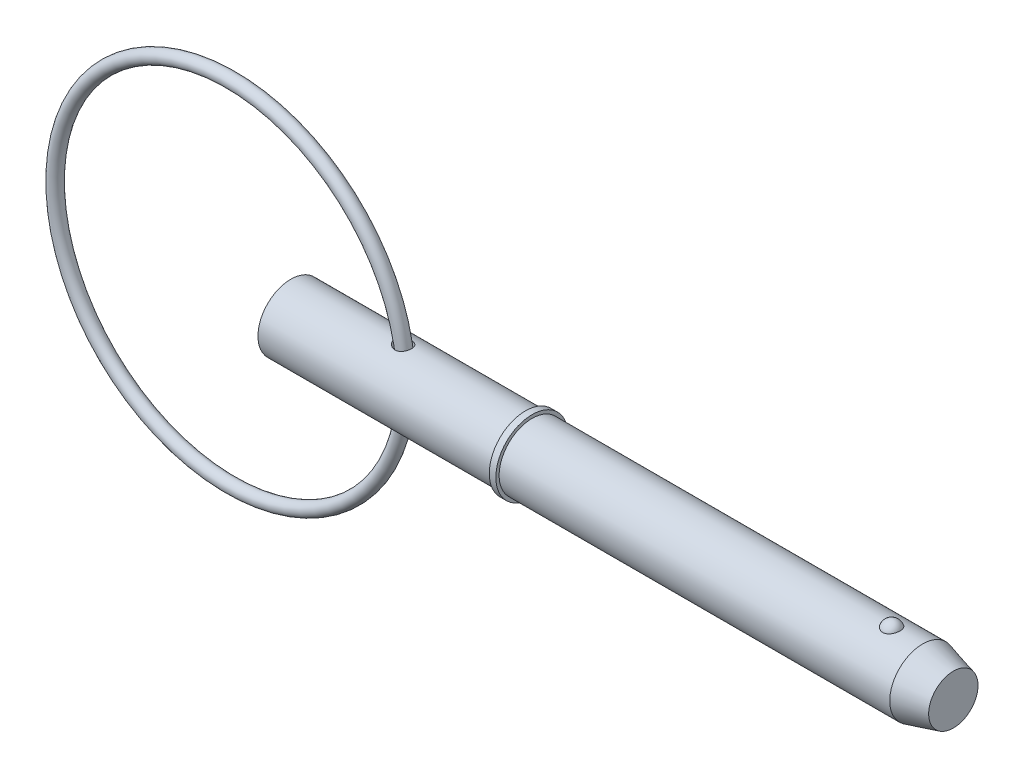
ISO-10303-21;
HEADER;
FILE_DESCRIPTION(('STEP AP214'),'2;1');
FILE_NAME('part.step','',(''),(''),'','','');
FILE_SCHEMA(('AUTOMOTIVE_DESIGN { 1 0 10303 214 1 1 1 1 }'));
ENDSEC;
DATA;
#1=APPLICATION_CONTEXT('core data for automotive mechanical design processes');
#2=APPLICATION_PROTOCOL_DEFINITION('international standard','automotive_design',2000,#1);
#3=PRODUCT_CONTEXT('',#1,'mechanical');
#4=PRODUCT('Part','Part','',(#3));
#5=PRODUCT_RELATED_PRODUCT_CATEGORY('part','',(#4));
#6=PRODUCT_DEFINITION_FORMATION('','',#4);
#7=PRODUCT_DEFINITION_CONTEXT('part definition',#1,'design');
#8=PRODUCT_DEFINITION('design','',#6,#7);
#9=PRODUCT_DEFINITION_SHAPE('','',#8);
#10=(LENGTH_UNIT() NAMED_UNIT(*) SI_UNIT(.MILLI.,.METRE.));
#11=(NAMED_UNIT(*) PLANE_ANGLE_UNIT() SI_UNIT($,.RADIAN.));
#12=(NAMED_UNIT(*) SI_UNIT($,.STERADIAN.) SOLID_ANGLE_UNIT());
#13=UNCERTAINTY_MEASURE_WITH_UNIT(LENGTH_MEASURE(1.E-05),#10,'distance_accuracy_value','');
#14=(GEOMETRIC_REPRESENTATION_CONTEXT(3) GLOBAL_UNCERTAINTY_ASSIGNED_CONTEXT((#13)) GLOBAL_UNIT_ASSIGNED_CONTEXT((#10,
#11,#12)) REPRESENTATION_CONTEXT('',''));
#15=CARTESIAN_POINT('',(0.,0.,0.));
#16=DIRECTION('',(0.,0.,1.));
#17=DIRECTION('',(1.,0.,0.));
#18=AXIS2_PLACEMENT_3D('',#15,#16,#17);
#19=CARTESIAN_POINT('',(-4.3552379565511,0.,0.));
#20=DIRECTION('',(0.,0.,1.));
#21=DIRECTION('',(1.,0.,0.));
#22=AXIS2_PLACEMENT_3D('',#19,#20,#21);
#23=TOROIDAL_SURFACE('',#22,12.7,0.476000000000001);
#24=CARTESIAN_POINT('',(8.8207620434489,0.,0.));
#25=VERTEX_POINT('',#24);
#26=VERTEX_LOOP('',#25);
#27=FACE_BOUND('',#26,.T.);
#28=ADVANCED_FACE('P0_F12',(#27),#23,.T.);
#29=CLOSED_SHELL('',(#28));
#30=MANIFOLD_SOLID_BREP('P0_B1',#29);
#31=CARTESIAN_POINT('',(0.,0.,0.));
#32=DIRECTION('',(1.,0.,0.));
#33=DIRECTION('',(0.,0.,-1.));
#34=AXIS2_PLACEMENT_3D('',#31,#32,#33);
#35=CYLINDRICAL_SURFACE('',#34,2.38);
#36=CARTESIAN_POINT('',(7.58975148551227,2.36313886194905,-0.28279801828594));
#37=CARTESIAN_POINT('',(7.6071494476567,2.3595137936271,-0.313086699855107));
#38=CARTESIAN_POINT('',(7.62722970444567,2.35548219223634,-0.341811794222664));
#39=CARTESIAN_POINT('',(7.6719764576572,2.34708028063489,-0.395416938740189));
#40=CARTESIAN_POINT('',(7.69665038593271,2.34270942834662,-0.420290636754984));
#41=CARTESIAN_POINT('',(7.74972661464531,2.33413422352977,-0.465561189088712));
#42=CARTESIAN_POINT('',(7.77811964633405,2.3299294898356,-0.485968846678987));
#43=CARTESIAN_POINT('',(7.83790446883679,2.32214293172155,-0.521911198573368));
#44=CARTESIAN_POINT('',(7.86929545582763,2.31856094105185,-0.537447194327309));
#45=CARTESIAN_POINT('',(7.93519088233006,2.31234960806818,-0.563583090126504));
#46=CARTESIAN_POINT('',(7.96975762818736,2.30974952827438,-0.574033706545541));
#47=CARTESIAN_POINT('',(8.04024488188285,2.3060008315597,-0.588914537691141));
#48=CARTESIAN_POINT('',(8.07616512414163,2.3048519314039,-0.593345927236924));
#49=CARTESIAN_POINT('',(8.14695871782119,2.30420789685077,-0.595841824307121));
#50=CARTESIAN_POINT('',(8.18182355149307,2.30465507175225,-0.594128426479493));
#51=CARTESIAN_POINT('',(8.25068512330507,2.30705630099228,-0.584734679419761));
#52=CARTESIAN_POINT('',(8.28468213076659,2.30900988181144,-0.577056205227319));
#53=CARTESIAN_POINT('',(8.34906698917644,2.31406811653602,-0.556412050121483));
#54=CARTESIAN_POINT('',(8.37955021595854,2.31711087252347,-0.543727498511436));
#55=CARTESIAN_POINT('',(8.43786372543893,2.32400968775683,-0.513438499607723));
#56=CARTESIAN_POINT('',(8.46569411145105,2.32786571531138,-0.495834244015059));
#57=CARTESIAN_POINT('',(8.51768626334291,2.33591620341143,-0.456393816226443));
#58=CARTESIAN_POINT('',(8.54188060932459,2.34010706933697,-0.434599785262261));
#59=CARTESIAN_POINT('',(8.58630752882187,2.34840208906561,-0.387277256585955));
#60=CARTESIAN_POINT('',(8.60653982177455,2.35250623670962,-0.361748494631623));
#61=CARTESIAN_POINT('',(8.64282785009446,2.36024850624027,-0.307237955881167));
#62=CARTESIAN_POINT('',(8.65881497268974,2.36387854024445,-0.278209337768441));
#63=CARTESIAN_POINT('',(8.68580879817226,2.37020506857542,-0.217827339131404));
#64=CARTESIAN_POINT('',(8.69681534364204,2.37290153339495,-0.18647388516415));
#65=CARTESIAN_POINT('',(8.71363969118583,2.37708738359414,-0.122079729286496));
#66=CARTESIAN_POINT('',(8.71941899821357,2.37856780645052,-0.0890283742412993));
#67=CARTESIAN_POINT('',(8.72550469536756,2.38012793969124,-0.0223933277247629));
#68=CARTESIAN_POINT('',(8.72581115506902,2.38020766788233,0.0111903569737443));
#69=CARTESIAN_POINT('',(8.72094957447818,2.37895941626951,0.0778527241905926));
#70=CARTESIAN_POINT('',(8.71579439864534,2.377634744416,0.110932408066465));
#71=CARTESIAN_POINT('',(8.70015845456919,2.37372548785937,0.175731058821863));
#72=CARTESIAN_POINT('',(8.68967753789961,2.37114086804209,0.207449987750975));
#73=CARTESIAN_POINT('',(8.66363496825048,2.36498751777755,0.268667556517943));
#74=CARTESIAN_POINT('',(8.64806773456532,2.36141770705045,0.298163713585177));
#75=CARTESIAN_POINT('',(8.61223946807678,2.35368505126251,0.354067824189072));
#76=CARTESIAN_POINT('',(8.59197833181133,2.34952219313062,0.380475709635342));
#77=CARTESIAN_POINT('',(8.54726357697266,2.34106443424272,0.429460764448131));
#78=CARTESIAN_POINT('',(8.52280850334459,2.33676948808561,0.452036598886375));
#79=CARTESIAN_POINT('',(8.47035669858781,2.3285376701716,0.49269040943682));
#80=CARTESIAN_POINT('',(8.44236041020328,2.32460075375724,0.510768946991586));
#81=CARTESIAN_POINT('',(8.38398546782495,2.31758529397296,0.541708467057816));
#82=CARTESIAN_POINT('',(8.35364184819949,2.31449641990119,0.554633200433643));
#83=CARTESIAN_POINT('',(8.29114127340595,2.30945817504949,0.575253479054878));
#84=CARTESIAN_POINT('',(8.25898451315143,2.30750868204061,0.582949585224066));
#85=CARTESIAN_POINT('',(8.19412910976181,2.30496641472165,0.592921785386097));
#86=CARTESIAN_POINT('',(8.161439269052,2.30436008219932,0.595252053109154));
#87=CARTESIAN_POINT('',(8.09610955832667,2.30450130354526,0.594704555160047));
#88=CARTESIAN_POINT('',(8.0634696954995,2.30524903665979,0.591826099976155));
#89=CARTESIAN_POINT('',(7.99825736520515,2.30802121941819,0.580921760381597));
#90=CARTESIAN_POINT('',(7.96570822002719,2.31007800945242,0.572765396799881));
#91=CARTESIAN_POINT('',(7.90235775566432,2.31524655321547,0.551500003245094));
#92=CARTESIAN_POINT('',(7.87155698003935,2.31835863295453,0.53838944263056));
#93=CARTESIAN_POINT('',(7.81084906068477,2.32548378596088,0.506755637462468));
#94=CARTESIAN_POINT('',(7.78107737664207,2.32953608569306,0.487980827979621));
#95=CARTESIAN_POINT('',(7.72506412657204,2.33797565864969,0.445793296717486));
#96=CARTESIAN_POINT('',(7.69882353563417,2.34236302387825,0.422379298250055));
#97=CARTESIAN_POINT('',(7.65019002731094,2.35106473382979,0.370927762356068));
#98=CARTESIAN_POINT('',(7.62788209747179,2.35537598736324,0.342808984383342));
#99=CARTESIAN_POINT('',(7.58861130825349,2.36331071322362,0.282967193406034));
#100=CARTESIAN_POINT('',(7.57164595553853,2.3669345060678,0.251245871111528));
#101=CARTESIAN_POINT('',(7.54465876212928,2.37284705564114,0.187017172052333));
#102=CARTESIAN_POINT('',(7.5342924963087,2.37520082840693,0.154660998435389));
#103=CARTESIAN_POINT('',(7.51954252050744,2.37858198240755,0.0885446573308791));
#104=CARTESIAN_POINT('',(7.51515589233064,2.37961001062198,0.0547851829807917));
#105=CARTESIAN_POINT('',(7.51270681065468,2.38018226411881,-0.0102367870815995));
#106=CARTESIAN_POINT('',(7.51416323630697,2.37983937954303,-0.0414812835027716));
#107=CARTESIAN_POINT('',(7.52225907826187,2.37796025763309,-0.103234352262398));
#108=CARTESIAN_POINT('',(7.52889419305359,2.37642501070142,-0.133743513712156));
#109=CARTESIAN_POINT('',(7.54430841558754,2.37294751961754,-0.184277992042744));
#110=CARTESIAN_POINT('',(7.55185254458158,2.37126438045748,-0.204709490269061));
#111=CARTESIAN_POINT('',(7.56916989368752,2.36748607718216,-0.244561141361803));
#112=CARTESIAN_POINT('',(7.57894307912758,2.36539091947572,-0.263981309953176));
#113=CARTESIAN_POINT('',(7.58975148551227,2.36313886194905,-0.28279801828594));
#114=B_SPLINE_CURVE_WITH_KNOTS('',3,(#36,#37,#38,#39,#40,#41,#42,#43,#44,#45,#46,#47,#48,#49,
#50,#51,#52,#53,#54,#55,#56,#57,#58,#59,#60,#61,#62,#63,#64,#65,#66,#67,#68,#69,#70,#71,#72,#73,
#74,#75,#76,#77,#78,#79,#80,#81,#82,#83,#84,#85,#86,#87,#88,#89,#90,#91,#92,#93,#94,#95,#96,#97,
#98,#99,#100,#101,#102,#103,#104,#105,#106,#107,#108,#109,#110,#111,#112,#113),.UNSPECIFIED.,
.T.,.F.,(4,2,2,2,2,2,2,2,2,2,2,2,2,2,2,2,2,2,2,2,2,2,2,2,2,2,2,2,2,2,2,2,2,2,2,2,2,2,4),(0.,
0.105267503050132,0.210706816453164,0.315888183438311,0.421041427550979,0.529118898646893,
0.637175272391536,0.741366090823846,0.84552417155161,0.944516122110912,1.04350421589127,
1.14154435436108,1.23959143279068,1.33913812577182,1.43868796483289,1.53896508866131,
1.63924093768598,1.73928111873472,1.83932408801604,1.93947719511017,2.03963250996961,
2.13982264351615,2.24000026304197,2.33889712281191,2.43778337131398,2.53566679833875,
2.63356318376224,2.73397729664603,2.83442245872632,2.94022921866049,3.04606513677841,
3.15396441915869,3.26181327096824,3.36343346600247,3.46500405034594,3.55839004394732,
3.65169855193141,3.71709653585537,3.78249350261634),.UNSPECIFIED.);
#115=CARTESIAN_POINT('',(7.58975148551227,2.36313886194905,-0.28279801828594));
#116=VERTEX_POINT('',#115);
#117=EDGE_CURVE('P1_E42',#116,#116,#114,.T.);
#118=ORIENTED_EDGE('',*,*,#117,.T.);
#119=EDGE_LOOP('',(#118));
#120=FACE_BOUND('',#119,.T.);
#121=CARTESIAN_POINT('',(0.,0.,0.));
#122=DIRECTION('',(1.,0.,0.));
#123=DIRECTION('',(0.,0.,-1.));
#124=AXIS2_PLACEMENT_3D('',#121,#122,#123);
#125=CIRCLE('',#124,2.38);
#126=CARTESIAN_POINT('',(0.,0.,-2.38));
#127=VERTEX_POINT('',#126);
#128=EDGE_CURVE('P1_E9',#127,#127,#125,.T.);
#129=ORIENTED_EDGE('',*,*,#128,.T.);
#130=EDGE_LOOP('',(#129));
#131=FACE_BOUND('',#130,.T.);
#132=CARTESIAN_POINT('',(16.974,0.,0.));
#133=DIRECTION('',(1.,0.,0.));
#134=DIRECTION('',(0.,0.,-1.));
#135=AXIS2_PLACEMENT_3D('',#132,#133,#134);
#136=CIRCLE('',#135,2.38);
#137=CARTESIAN_POINT('',(16.974,0.,-2.38));
#138=VERTEX_POINT('',#137);
#139=EDGE_CURVE('P1_E25',#138,#138,#136,.T.);
#140=ORIENTED_EDGE('',*,*,#139,.F.);
#141=EDGE_LOOP('',(#140));
#142=FACE_BOUND('',#141,.T.);
#143=CARTESIAN_POINT('',(7.58975148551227,-2.36313886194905,-0.28279801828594));
#144=CARTESIAN_POINT('',(7.57418830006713,-2.3663814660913,-0.255701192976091));
#145=CARTESIAN_POINT('',(7.56076205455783,-2.36930044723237,-0.227336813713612));
#146=CARTESIAN_POINT('',(7.53869583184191,-2.37419355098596,-0.168724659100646));
#147=CARTESIAN_POINT('',(7.53005409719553,-2.37616802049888,-0.138477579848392));
#148=CARTESIAN_POINT('',(7.5179268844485,-2.37895970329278,-0.0768369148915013));
#149=CARTESIAN_POINT('',(7.51445304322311,-2.37977430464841,-0.0454409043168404));
#150=CARTESIAN_POINT('',(7.51287156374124,-2.38014365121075,0.0174935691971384));
#151=CARTESIAN_POINT('',(7.51476360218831,-2.37969847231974,0.0490320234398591));
#152=CARTESIAN_POINT('',(7.52368198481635,-2.37763188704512,0.11036883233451));
#153=CARTESIAN_POINT('',(7.53055435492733,-2.37604576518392,0.140191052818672));
#154=CARTESIAN_POINT('',(7.54895588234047,-2.37190466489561,0.19828599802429));
#155=CARTESIAN_POINT('',(7.56048572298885,-2.36934954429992,0.226558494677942));
#156=CARTESIAN_POINT('',(7.58819257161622,-2.36343089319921,0.281762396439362));
#157=CARTESIAN_POINT('',(7.60450508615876,-2.36004434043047,0.308623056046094));
#158=CARTESIAN_POINT('',(7.64106334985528,-2.35283977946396,0.359451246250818));
#159=CARTESIAN_POINT('',(7.6613104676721,-2.34902162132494,0.383417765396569));
#160=CARTESIAN_POINT('',(7.70695754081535,-2.34099193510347,0.429832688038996));
#161=CARTESIAN_POINT('',(7.73264232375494,-2.33677362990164,0.45200004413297));
#162=CARTESIAN_POINT('',(7.78725305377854,-2.32868304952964,0.491988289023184));
#163=CARTESIAN_POINT('',(7.81618023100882,-2.32481090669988,0.509807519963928));
#164=CARTESIAN_POINT('',(7.87824201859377,-2.31763132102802,0.541539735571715));
#165=CARTESIAN_POINT('',(7.91152093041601,-2.31436703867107,0.555181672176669));
#166=CARTESIAN_POINT('',(7.97999150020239,-2.30909873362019,0.576703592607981));
#167=CARTESIAN_POINT('',(8.01518292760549,-2.30709455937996,0.584584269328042));
#168=CARTESIAN_POINT('',(8.08580757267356,-2.30465743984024,0.594119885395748));
#169=CARTESIAN_POINT('',(8.12122470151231,-2.30419653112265,0.595885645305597));
#170=CARTESIAN_POINT('',(8.19181659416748,-2.30486796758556,0.593284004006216));
#171=CARTESIAN_POINT('',(8.22699144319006,-2.30599972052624,0.588918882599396));
#172=CARTESIAN_POINT('',(8.29408987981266,-2.30963941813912,0.574470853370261));
#173=CARTESIAN_POINT('',(8.32608666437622,-2.31207030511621,0.564707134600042));
#174=CARTESIAN_POINT('',(8.38787213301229,-2.31798180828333,0.539927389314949));
#175=CARTESIAN_POINT('',(8.41766103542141,-2.32146232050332,0.524911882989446));
#176=CARTESIAN_POINT('',(8.47353661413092,-2.32898511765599,0.490439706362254));
#177=CARTESIAN_POINT('',(8.49969091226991,-2.33301318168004,0.471089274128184));
#178=CARTESIAN_POINT('',(8.54838372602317,-2.34124455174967,0.428307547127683));
#179=CARTESIAN_POINT('',(8.57092204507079,-2.34544786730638,0.404876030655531));
#180=CARTESIAN_POINT('',(8.61207557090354,-2.35362667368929,0.354267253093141));
#181=CARTESIAN_POINT('',(8.63063940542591,-2.35759874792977,0.3270476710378));
#182=CARTESIAN_POINT('',(8.66303816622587,-2.36482918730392,0.269839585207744));
#183=CARTESIAN_POINT('',(8.67687284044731,-2.36808751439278,0.23985093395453));
#184=CARTESIAN_POINT('',(8.69960621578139,-2.37357381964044,0.177579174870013));
#185=CARTESIAN_POINT('',(8.7084473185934,-2.3757897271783,0.145273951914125));
#186=CARTESIAN_POINT('',(8.72072898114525,-2.37889592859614,0.0795911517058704));
#187=CARTESIAN_POINT('',(8.72416959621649,-2.37978623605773,0.0462135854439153));
#188=CARTESIAN_POINT('',(8.72556332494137,-2.38014500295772,-0.0206284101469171));
#189=CARTESIAN_POINT('',(8.72352221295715,-2.37961495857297,-0.0540927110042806));
#190=CARTESIAN_POINT('',(8.71401607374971,-2.37719332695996,-0.12019135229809));
#191=CARTESIAN_POINT('',(8.70655097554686,-2.37530172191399,-0.152825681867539));
#192=CARTESIAN_POINT('',(8.68638818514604,-2.37036240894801,-0.216324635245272));
#193=CARTESIAN_POINT('',(8.67369312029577,-2.36731528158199,-0.247190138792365));
#194=CARTESIAN_POINT('',(8.64338307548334,-2.36039503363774,-0.306303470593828));
#195=CARTESIAN_POINT('',(8.62576790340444,-2.35652188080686,-0.334551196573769));
#196=CARTESIAN_POINT('',(8.58601062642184,-2.34836581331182,-0.387689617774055));
#197=CARTESIAN_POINT('',(8.56385884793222,-2.34408203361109,-0.412572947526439));
#198=CARTESIAN_POINT('',(8.51562034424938,-2.33559361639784,-0.458194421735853));
#199=CARTESIAN_POINT('',(8.4895339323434,-2.33138897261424,-0.478932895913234));
#200=CARTESIAN_POINT('',(8.43437902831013,-2.32357677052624,-0.515498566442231));
#201=CARTESIAN_POINT('',(8.40533919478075,-2.31996422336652,-0.531367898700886));
#202=CARTESIAN_POINT('',(8.3449114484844,-2.31370413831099,-0.557997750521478));
#203=CARTESIAN_POINT('',(8.31352388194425,-2.31105645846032,-0.568759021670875));
#204=CARTESIAN_POINT('',(8.24979053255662,-2.30704987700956,-0.584798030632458));
#205=CARTESIAN_POINT('',(8.2174653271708,-2.30567279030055,-0.590153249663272));
#206=CARTESIAN_POINT('',(8.15234941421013,-2.3042717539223,-0.595600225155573));
#207=CARTESIAN_POINT('',(8.11955868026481,-2.30424788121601,-0.595691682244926));
#208=CARTESIAN_POINT('',(8.05396041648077,-2.30553291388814,-0.590698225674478));
#209=CARTESIAN_POINT('',(8.02115865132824,-2.30685983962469,-0.585543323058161));
#210=CARTESIAN_POINT('',(7.95682322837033,-2.31069752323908,-0.570209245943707));
#211=CARTESIAN_POINT('',(7.9252899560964,-2.31320863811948,-0.560028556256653));
#212=CARTESIAN_POINT('',(7.86270639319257,-2.31927991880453,-0.534343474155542));
#213=CARTESIAN_POINT('',(7.83175966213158,-2.32288638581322,-0.51859766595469));
#214=CARTESIAN_POINT('',(7.7728658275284,-2.33068292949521,-0.48234820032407));
#215=CARTESIAN_POINT('',(7.74491930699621,-2.33487311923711,-0.461843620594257));
#216=CARTESIAN_POINT('',(7.69322838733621,-2.34330635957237,-0.416926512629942));
#217=CARTESIAN_POINT('',(7.66941974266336,-2.34754724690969,-0.392587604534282));
#218=CARTESIAN_POINT('',(7.62614930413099,-2.35569931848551,-0.340264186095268));
#219=CARTESIAN_POINT('',(7.60668542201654,-2.35961066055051,-0.312281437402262));
#220=CARTESIAN_POINT('',(7.58975148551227,-2.36313886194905,-0.28279801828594));
#221=B_SPLINE_CURVE_WITH_KNOTS('',3,(#143,#144,#145,#146,#147,#148,#149,#150,#151,#152,#153,
#154,#155,#156,#157,#158,#159,#160,#161,#162,#163,#164,#165,#166,#167,#168,#169,#170,#171,#172,
#173,#174,#175,#176,#177,#178,#179,#180,#181,#182,#183,#184,#185,#186,#187,#188,#189,#190,#191,
#192,#193,#194,#195,#196,#197,#198,#199,#200,#201,#202,#203,#204,#205,#206,#207,#208,#209,#210,
#211,#212,#213,#214,#215,#216,#217,#218,#219,#220),.UNSPECIFIED.,.T.,.F.,(4,2,2,2,2,2,2,2,2,2,2,
2,2,2,2,2,2,2,2,2,2,2,2,2,2,2,2,2,2,2,2,2,2,2,2,2,2,2,4),(0.,0.0941407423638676,
0.188246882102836,0.282564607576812,0.376876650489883,0.468390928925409,0.559918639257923,
0.654342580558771,0.748799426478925,0.850921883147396,0.953083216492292,1.06090345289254,
1.16871071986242,1.2745536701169,1.38035727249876,1.48048681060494,1.58060643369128,
1.67849861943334,1.7763961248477,1.87549138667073,1.97459192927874,2.07481335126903,
2.17503374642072,2.27514861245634,2.37526478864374,2.47533073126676,2.57540058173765,
2.67568607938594,2.77596359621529,2.87534713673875,2.97471604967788,3.07263964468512,
3.17056880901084,3.26982174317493,3.36910461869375,3.47336737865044,3.57765036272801,
3.68013205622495,3.78256438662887),.UNSPECIFIED.);
#222=CARTESIAN_POINT('',(7.58975148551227,-2.36313886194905,-0.28279801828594));
#223=VERTEX_POINT('',#222);
#224=EDGE_CURVE('P1_E17',#223,#223,#221,.T.);
#225=ORIENTED_EDGE('',*,*,#224,.T.);
#226=EDGE_LOOP('',(#225));
#227=FACE_BOUND('',#226,.T.);
#228=ADVANCED_FACE('P1_F13',(#120,#131,#142,#227),#35,.T.);
#229=CARTESIAN_POINT('',(0.,0.,0.));
#230=DIRECTION('',(1.,0.,0.));
#231=DIRECTION('',(0.,0.,-1.));
#232=AXIS2_PLACEMENT_3D('',#229,#230,#231);
#233=CYLINDRICAL_SURFACE('',#232,2.38);
#234=CARTESIAN_POINT('',(45.7094297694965,0.,0.));
#235=DIRECTION('',(1.,0.,0.));
#236=DIRECTION('',(0.,0.,-1.));
#237=AXIS2_PLACEMENT_3D('',#234,#235,#236);
#238=CIRCLE('',#237,2.38);
#239=CARTESIAN_POINT('',(45.7094297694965,0.,-2.38));
#240=VERTEX_POINT('',#239);
#241=EDGE_CURVE('P1_E99',#240,#240,#238,.T.);
#242=ORIENTED_EDGE('',*,*,#241,.F.);
#243=EDGE_LOOP('',(#242));
#244=FACE_BOUND('',#243,.T.);
#245=CARTESIAN_POINT('',(17.45,0.,0.));
#246=DIRECTION('',(1.,0.,0.));
#247=DIRECTION('',(0.,0.,-1.));
#248=AXIS2_PLACEMENT_3D('',#245,#246,#247);
#249=CIRCLE('',#248,2.38);
#250=CARTESIAN_POINT('',(17.45,0.,-2.38));
#251=VERTEX_POINT('',#250);
#252=EDGE_CURVE('P1_E96',#251,#251,#249,.T.);
#253=ORIENTED_EDGE('',*,*,#252,.T.);
#254=EDGE_LOOP('',(#253));
#255=FACE_BOUND('',#254,.T.);
#256=CARTESIAN_POINT('',(43.4634492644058,2.2921568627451,0.640637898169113));
#257=CARTESIAN_POINT('',(43.4303559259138,2.29215737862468,0.64063719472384));
#258=CARTESIAN_POINT('',(43.3972546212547,2.29293179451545,0.637884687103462));
#259=CARTESIAN_POINT('',(43.3320176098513,2.29594030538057,0.626968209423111));
#260=CARTESIAN_POINT('',(43.2998823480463,2.29817506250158,0.61880178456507));
#261=CARTESIAN_POINT('',(43.2375402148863,2.3038430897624,0.597351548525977));
#262=CARTESIAN_POINT('',(43.2073305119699,2.30727454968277,0.584075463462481));
#263=CARTESIAN_POINT('',(43.1495674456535,2.31495941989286,0.552829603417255));
#264=CARTESIAN_POINT('',(43.1220141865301,2.31921286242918,0.534859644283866));
#265=CARTESIAN_POINT('',(43.0695938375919,2.32820213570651,0.494282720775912));
#266=CARTESIAN_POINT('',(43.0448050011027,2.33294694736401,0.47157679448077));
#267=CARTESIAN_POINT('',(42.9992169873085,2.34234144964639,0.422446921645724));
#268=CARTESIAN_POINT('',(42.9784185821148,2.34699112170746,0.396022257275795));
#269=CARTESIAN_POINT('',(42.9403580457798,2.35593942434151,0.338855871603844));
#270=CARTESIAN_POINT('',(42.9233051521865,2.36021170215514,0.307970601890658));
#271=CARTESIAN_POINT('',(42.8943607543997,2.3677057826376,0.243750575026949));
#272=CARTESIAN_POINT('',(42.8824701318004,2.37092740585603,0.210415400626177));
#273=CARTESIAN_POINT('',(42.8638076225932,2.37606901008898,0.141189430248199));
#274=CARTESIAN_POINT('',(42.8571956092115,2.37794816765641,0.105252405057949));
#275=CARTESIAN_POINT('',(42.8498095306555,2.38005135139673,0.032735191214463));
#276=CARTESIAN_POINT('',(42.8490358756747,2.38027526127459,-0.00384504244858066));
#277=CARTESIAN_POINT('',(42.8533628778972,2.37903842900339,-0.0769838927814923));
#278=CARTESIAN_POINT('',(42.8585202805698,2.37756141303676,-0.1135388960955));
#279=CARTESIAN_POINT('',(42.8747013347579,2.37305303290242,-0.185229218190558));
#280=CARTESIAN_POINT('',(42.8857251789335,2.37002161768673,-0.220364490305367));
#281=CARTESIAN_POINT('',(42.9133977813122,2.36273722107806,-0.288156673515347));
#282=CARTESIAN_POINT('',(42.9300389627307,2.35848588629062,-0.320816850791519));
#283=CARTESIAN_POINT('',(42.9685984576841,2.34923130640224,-0.382744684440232));
#284=CARTESIAN_POINT('',(42.990516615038,2.34422808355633,-0.412012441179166));
#285=CARTESIAN_POINT('',(43.0387549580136,2.33412555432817,-0.465830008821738));
#286=CARTESIAN_POINT('',(43.0650028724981,2.32902887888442,-0.490444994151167));
#287=CARTESIAN_POINT('',(43.1214769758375,2.31926941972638,-0.534700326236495));
#288=CARTESIAN_POINT('',(43.1517022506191,2.3146065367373,-0.554341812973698));
#289=CARTESIAN_POINT('',(43.2140618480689,2.30645675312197,-0.587312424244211));
#290=CARTESIAN_POINT('',(43.2460780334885,2.30293152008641,-0.600855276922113));
#291=CARTESIAN_POINT('',(43.3120795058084,2.29725171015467,-0.622220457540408));
#292=CARTESIAN_POINT('',(43.3460641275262,2.29509667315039,-0.630044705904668));
#293=CARTESIAN_POINT('',(43.413299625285,2.29249264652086,-0.639452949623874));
#294=CARTESIAN_POINT('',(43.4465087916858,2.29196755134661,-0.641315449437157));
#295=CARTESIAN_POINT('',(43.512763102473,2.29246849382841,-0.639522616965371));
#296=CARTESIAN_POINT('',(43.5458082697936,2.29349430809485,-0.635868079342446));
#297=CARTESIAN_POINT('',(43.6101025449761,2.29694059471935,-0.623301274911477));
#298=CARTESIAN_POINT('',(43.6413744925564,2.29933234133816,-0.614497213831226));
#299=CARTESIAN_POINT('',(43.7019952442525,2.30522511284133,-0.592006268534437));
#300=CARTESIAN_POINT('',(43.7313438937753,2.30872622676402,-0.578318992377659));
#301=CARTESIAN_POINT('',(43.7880369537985,2.31655795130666,-0.546112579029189));
#302=CARTESIAN_POINT('',(43.815320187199,2.32090569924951,-0.527490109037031));
#303=CARTESIAN_POINT('',(43.8664904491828,2.32992206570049,-0.486117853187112));
#304=CARTESIAN_POINT('',(43.8903767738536,2.33459075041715,-0.46336721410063));
#305=CARTESIAN_POINT('',(43.9352722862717,2.34399834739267,-0.413220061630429));
#306=CARTESIAN_POINT('',(43.9560972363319,2.34873051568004,-0.385657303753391));
#307=CARTESIAN_POINT('',(43.993056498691,2.35754932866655,-0.327455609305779));
#308=CARTESIAN_POINT('',(44.0091898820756,2.36163584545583,-0.296816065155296));
#309=CARTESIAN_POINT('',(44.0369822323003,2.36889321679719,-0.232047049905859));
#310=CARTESIAN_POINT('',(44.0484450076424,2.37202275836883,-0.197828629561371));
#311=CARTESIAN_POINT('',(44.0657523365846,2.37681926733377,-0.127900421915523));
#312=CARTESIAN_POINT('',(44.0715962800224,2.37848607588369,-0.0921904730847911));
#313=CARTESIAN_POINT('',(44.077605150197,2.38020024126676,-0.0196348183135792));
#314=CARTESIAN_POINT('',(44.0776704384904,2.38021918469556,0.0172198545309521));
#315=CARTESIAN_POINT('',(44.0718689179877,2.37856356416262,0.0904219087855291));
#316=CARTESIAN_POINT('',(44.0660018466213,2.37688892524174,0.126769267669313));
#317=CARTESIAN_POINT('',(44.048425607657,2.37201688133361,0.19802859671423));
#318=CARTESIAN_POINT('',(44.0366998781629,2.36881516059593,0.232936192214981));
#319=CARTESIAN_POINT('',(44.0076354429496,2.36123444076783,0.300196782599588));
#320=CARTESIAN_POINT('',(43.9902967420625,2.3568554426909,0.332549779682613));
#321=CARTESIAN_POINT('',(43.9505350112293,2.34744667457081,0.39349541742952));
#322=CARTESIAN_POINT('',(43.9281528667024,2.34242227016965,0.422115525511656));
#323=CARTESIAN_POINT('',(43.8787391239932,2.33227293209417,0.475004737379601));
#324=CARTESIAN_POINT('',(43.8517076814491,2.32714800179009,0.499273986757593));
#325=CARTESIAN_POINT('',(43.7944988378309,2.31755359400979,0.542046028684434));
#326=CARTESIAN_POINT('',(43.7644297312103,2.3130698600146,0.560690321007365));
#327=CARTESIAN_POINT('',(43.7013869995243,2.30514125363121,0.592447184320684));
#328=CARTESIAN_POINT('',(43.6684158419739,2.30169550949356,0.605564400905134));
#329=CARTESIAN_POINT('',(43.6068424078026,2.29677744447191,0.623927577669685));
#330=CARTESIAN_POINT('',(43.5785555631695,2.29505839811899,0.630178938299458));
#331=CARTESIAN_POINT('',(43.5213308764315,2.29274795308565,0.638534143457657));
#332=CARTESIAN_POINT('',(43.4923931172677,2.29215641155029,0.640638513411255));
#333=CARTESIAN_POINT('',(43.4634492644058,2.2921568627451,0.640637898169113));
#334=B_SPLINE_CURVE_WITH_KNOTS('',3,(#256,#257,#258,#259,#260,#261,#262,#263,#264,#265,#266,
#267,#268,#269,#270,#271,#272,#273,#274,#275,#276,#277,#278,#279,#280,#281,#282,#283,#284,#285,
#286,#287,#288,#289,#290,#291,#292,#293,#294,#295,#296,#297,#298,#299,#300,#301,#302,#303,#304,
#305,#306,#307,#308,#309,#310,#311,#312,#313,#314,#315,#316,#317,#318,#319,#320,#321,#322,#323,
#324,#325,#326,#327,#328,#329,#330,#331,#332,#333),.UNSPECIFIED.,.T.,.F.,(4,2,2,2,2,2,2,2,2,2,2,
2,2,2,2,2,2,2,2,2,2,2,2,2,2,2,2,2,2,2,2,2,2,2,2,2,2,2,4),(0.,0.0991724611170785,
0.198389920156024,0.297457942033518,0.396529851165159,0.497927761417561,0.599345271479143,
0.705475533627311,0.811623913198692,0.92087671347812,1.03013718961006,1.14045177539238,
1.25076998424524,1.36093998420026,1.47110672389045,1.57959248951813,1.68805336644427,
1.79234266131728,1.89659691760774,1.99590391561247,2.09519661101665,2.19247425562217,
2.28975970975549,2.38926978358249,2.48880044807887,2.59293588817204,2.69709193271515,
2.80525821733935,2.91343624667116,3.02347917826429,3.13352698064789,3.24388765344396,
3.35424823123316,3.46374443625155,3.5732369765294,3.67968690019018,3.78604717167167,
3.87279565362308,3.9595331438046),.UNSPECIFIED.);
#335=CARTESIAN_POINT('',(43.4634492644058,2.2921568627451,0.640637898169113));
#336=VERTEX_POINT('',#335);
#337=EDGE_CURVE('P1_E34',#336,#336,#334,.T.);
#338=ORIENTED_EDGE('',*,*,#337,.T.);
#339=EDGE_LOOP('',(#338));
#340=FACE_BOUND('',#339,.T.);
#341=ADVANCED_FACE('P1_F46',(#244,#255,#340),#233,.T.);
#342=CARTESIAN_POINT('',(0.,0.,0.));
#343=DIRECTION('',(-1.,0.,0.));
#344=DIRECTION('',(0.,0.,1.));
#345=AXIS2_PLACEMENT_3D('',#342,#343,#344);
#346=PLANE('',#345);
#347=ORIENTED_EDGE('',*,*,#128,.F.);
#348=EDGE_LOOP('',(#347));
#349=FACE_BOUND('',#348,.T.);
#350=ADVANCED_FACE('P1_F15',(#349),#346,.T.);
#351=CARTESIAN_POINT('',(16.974,2.38,0.));
#352=DIRECTION('',(-1.,0.,0.));
#353=DIRECTION('',(0.,0.,1.));
#354=AXIS2_PLACEMENT_3D('',#351,#352,#353);
#355=PLANE('',#354);
#356=ORIENTED_EDGE('',*,*,#139,.T.);
#357=EDGE_LOOP('',(#356));
#358=FACE_BOUND('',#357,.T.);
#359=CARTESIAN_POINT('',(16.974,0.,0.));
#360=DIRECTION('',(1.,0.,0.));
#361=DIRECTION('',(0.,0.,-1.));
#362=AXIS2_PLACEMENT_3D('',#359,#360,#361);
#363=CIRCLE('',#362,2.618);
#364=CARTESIAN_POINT('',(16.974,0.,-2.618));
#365=VERTEX_POINT('',#364);
#366=EDGE_CURVE('P1_E30',#365,#365,#363,.T.);
#367=ORIENTED_EDGE('',*,*,#366,.F.);
#368=EDGE_LOOP('',(#367));
#369=FACE_BOUND('',#368,.T.);
#370=ADVANCED_FACE('P1_F81',(#358,#369),#355,.T.);
#371=CARTESIAN_POINT('',(0.,0.,0.));
#372=DIRECTION('',(1.,0.,0.));
#373=DIRECTION('',(0.,0.,-1.));
#374=AXIS2_PLACEMENT_3D('',#371,#372,#373);
#375=CYLINDRICAL_SURFACE('',#374,2.618);
#376=ORIENTED_EDGE('',*,*,#366,.T.);
#377=EDGE_LOOP('',(#376));
#378=FACE_BOUND('',#377,.T.);
#379=CARTESIAN_POINT('',(17.45,0.,0.));
#380=DIRECTION('',(1.,0.,0.));
#381=DIRECTION('',(0.,0.,-1.));
#382=AXIS2_PLACEMENT_3D('',#379,#380,#381);
#383=CIRCLE('',#382,2.618);
#384=CARTESIAN_POINT('',(17.45,0.,-2.618));
#385=VERTEX_POINT('',#384);
#386=EDGE_CURVE('P1_E95',#385,#385,#383,.T.);
#387=ORIENTED_EDGE('',*,*,#386,.F.);
#388=EDGE_LOOP('',(#387));
#389=FACE_BOUND('',#388,.T.);
#390=ADVANCED_FACE('P1_F68',(#378,#389),#375,.T.);
#391=CARTESIAN_POINT('',(17.45,2.618,0.));
#392=DIRECTION('',(1.,0.,0.));
#393=DIRECTION('',(0.,0.,-1.));
#394=AXIS2_PLACEMENT_3D('',#391,#392,#393);
#395=PLANE('',#394);
#396=ORIENTED_EDGE('',*,*,#386,.T.);
#397=EDGE_LOOP('',(#396));
#398=FACE_BOUND('',#397,.T.);
#399=ORIENTED_EDGE('',*,*,#252,.F.);
#400=EDGE_LOOP('',(#399));
#401=FACE_BOUND('',#400,.T.);
#402=ADVANCED_FACE('P1_F62',(#398,#401),#395,.T.);
#403=CARTESIAN_POINT('',(47.93,0.,0.));
#404=DIRECTION('',(-1.,0.,0.));
#405=DIRECTION('',(0.,0.,1.));
#406=AXIS2_PLACEMENT_3D('',#403,#404,#405);
#407=CONICAL_SURFACE('',#406,1.78500000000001,0.26179938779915);
#408=ORIENTED_EDGE('',*,*,#241,.T.);
#409=EDGE_LOOP('',(#408));
#410=FACE_BOUND('',#409,.T.);
#411=CARTESIAN_POINT('',(47.93,0.,0.));
#412=DIRECTION('',(1.,0.,0.));
#413=DIRECTION('',(0.,0.,-1.));
#414=AXIS2_PLACEMENT_3D('',#411,#412,#413);
#415=CIRCLE('',#414,1.78500000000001);
#416=CARTESIAN_POINT('',(47.93,0.,-1.78500000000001));
#417=VERTEX_POINT('',#416);
#418=EDGE_CURVE('P1_E41',#417,#417,#415,.T.);
#419=ORIENTED_EDGE('',*,*,#418,.F.);
#420=EDGE_LOOP('',(#419));
#421=FACE_BOUND('',#420,.T.);
#422=ADVANCED_FACE('P1_F59',(#410,#421),#407,.T.);
#423=CARTESIAN_POINT('',(47.93,1.78500000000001,0.));
#424=DIRECTION('',(1.,0.,0.));
#425=DIRECTION('',(0.,0.,-1.));
#426=AXIS2_PLACEMENT_3D('',#423,#424,#425);
#427=PLANE('',#426);
#428=ORIENTED_EDGE('',*,*,#418,.T.);
#429=EDGE_LOOP('',(#428));
#430=FACE_BOUND('',#429,.T.);
#431=ADVANCED_FACE('P1_F55',(#430),#427,.T.);
#432=CARTESIAN_POINT('',(43.4634492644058,2.142,0.));
#433=DIRECTION('',(-1.,0.,0.));
#434=DIRECTION('',(0.,1.,0.));
#435=AXIS2_PLACEMENT_3D('',#432,#433,#434);
#436=SPHERICAL_SURFACE('',#435,0.657999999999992);
#437=ORIENTED_EDGE('',*,*,#337,.F.);
#438=EDGE_LOOP('',(#437));
#439=FACE_BOUND('',#438,.T.);
#440=ADVANCED_FACE('P1_F50',(#439),#436,.T.);
#441=CARTESIAN_POINT('',(-4.3552379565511,0.,0.));
#442=DIRECTION('',(0.,0.,1.));
#443=DIRECTION('',(1.,0.,0.));
#444=AXIS2_PLACEMENT_3D('',#441,#442,#443);
#445=TOROIDAL_SURFACE('',#444,12.7,0.594999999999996);
#446=ORIENTED_EDGE('',*,*,#224,.F.);
#447=EDGE_LOOP('',(#446));
#448=FACE_BOUND('',#447,.T.);
#449=ORIENTED_EDGE('',*,*,#117,.F.);
#450=EDGE_LOOP('',(#449));
#451=FACE_BOUND('',#450,.T.);
#452=ADVANCED_FACE('P1_F54',(#448,#451),#445,.F.);
#453=CLOSED_SHELL('',(#228,#341,#350,#370,#390,#402,#422,#431,#440,#452));
#454=MANIFOLD_SOLID_BREP('P1_B1',#453);
#455=ADVANCED_BREP_SHAPE_REPRESENTATION('',(#18,#30,#454),#14);
#456=SHAPE_DEFINITION_REPRESENTATION(#9,#455);
ENDSEC;
END-ISO-10303-21;
